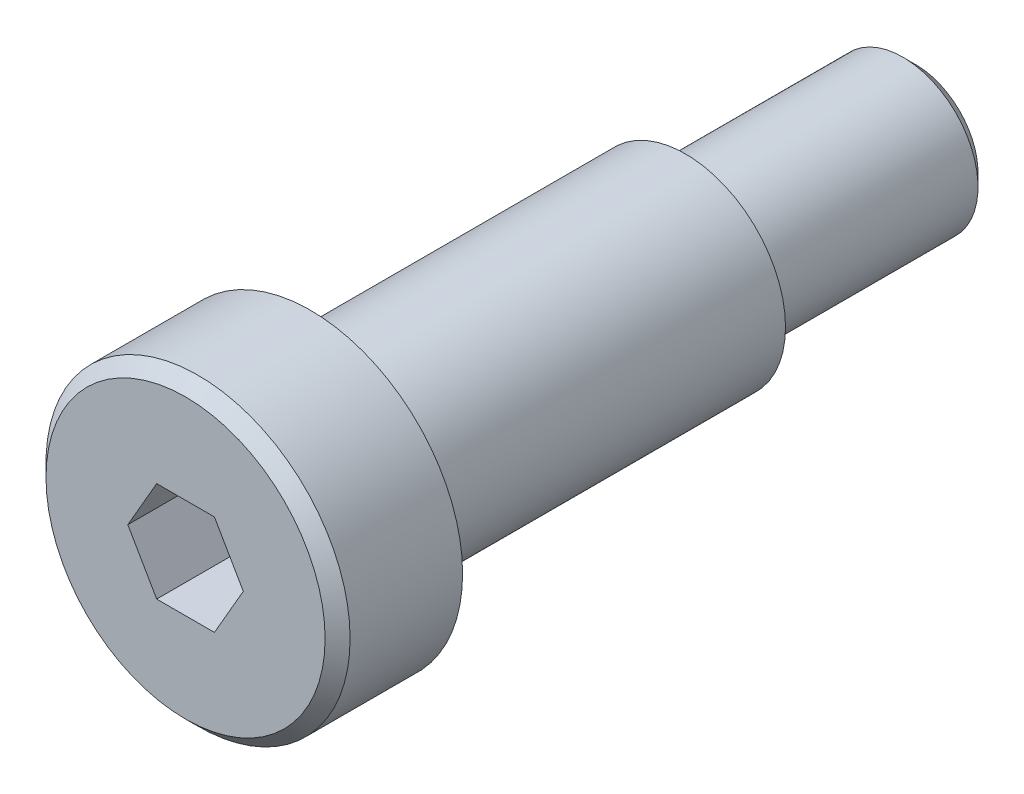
from build123d import *

# Parameters (mm, degrees)
ESQUISSE1_R             = 12.165
BOSS_EXTRU_1_DEPTH      = 10
ESQUISSE2_R             = 8
BOSS_EXTRU_2_DEPTH      = 30
ESQUISSE3_R             = 6
BOSS_EXTRU_3_DEPTH      = 18.4
CHANFREIN1_SIZE         = 1
ENL_V_MAT_EXTRU_1_DEPTH = 6.6


with BuildPart() as part:
    # Esquisse1 → Boss.-Extru.1 (new body)
    with BuildSketch(Plane.XY):
        Circle(ESQUISSE1_R)
    extrude(amount=BOSS_EXTRU_1_DEPTH)

    # Esquisse2 → Boss.-Extru.2 (add)
    with BuildSketch(Plane(origin=(0, 0, 0), x_dir=(-1, 0, 0), z_dir=(0, 0, -1))):
        with Locations(Location((0, 0, 0), (0, 0, 180))):
            Circle(ESQUISSE2_R)
    extrude(amount=BOSS_EXTRU_2_DEPTH)

    # Esquisse3 → Boss.-Extru.3 (add)
    with BuildSketch(Plane(origin=(0, 0, -30), x_dir=(-1, 0, 0), z_dir=(0, 0, -1))):
        Circle(ESQUISSE3_R)
    extrude(amount=BOSS_EXTRU_3_DEPTH)

    # Chanfrein1
    chanfrein1_edges = [part.edges().sort_by_distance(p)[0] for p in [
        (6, 0, -48.4),
        (-12.165, 0, 10),
    ]]
    chamfer(chanfrein1_edges, length=CHANFREIN1_SIZE)

    # Esquisse4 → Enl_v. mat.-Extru.1 (cut)
    with BuildSketch(Plane.XY.offset(10)):
        Polygon((4.618802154, 0), (2.309401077, 4), (-2.309401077, 4), (-4.618802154, 0), (-2.309401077, -4), (2.309401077, -4), align=None)
    extrude(amount=-ENL_V_MAT_EXTRU_1_DEPTH, mode=Mode.SUBTRACT)


solid = part.part
